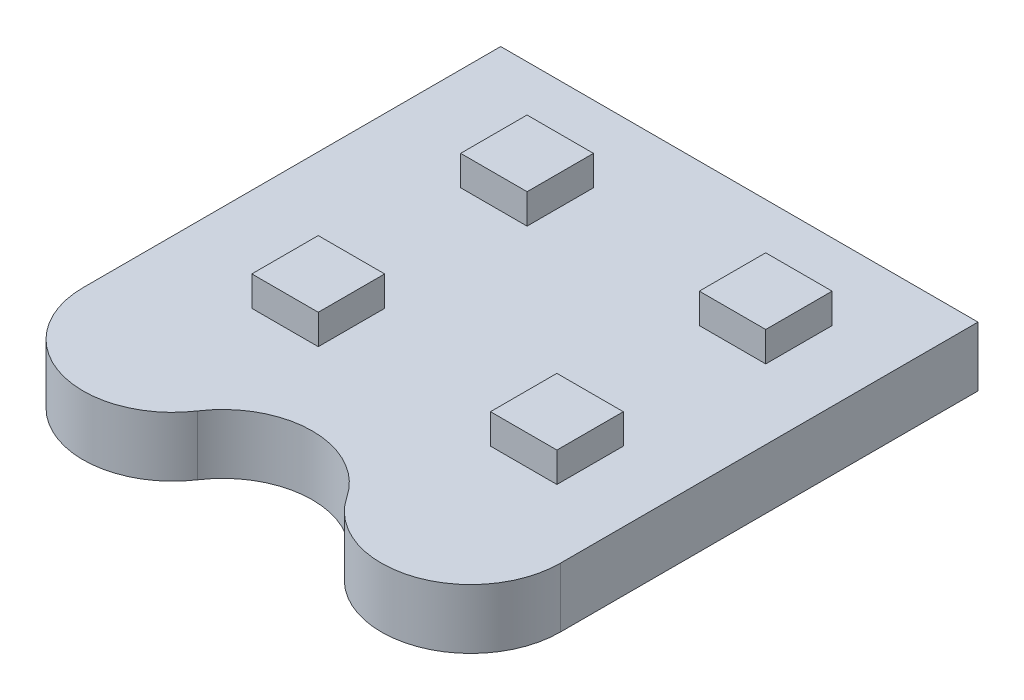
from build123d import *

# Parameters (mm, degrees)
EXTRUDE1_DEPTH       = 12.7
SKETCH3_W            = 14.141940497
SKETCH3_H            = 14.132678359
EXTRUDE2_DEPTH       = 6.35
LPATTERN1_COUNT      = 2
LPATTERN1_PITCH      = 44.45
LPATTERN1_COUNT_DIR2 = 2
LPATTERN1_PITCH_DIR2 = 50.8


with BuildPart() as part:
    # Sketch1 → Extrude1 (new body)
    with BuildSketch(Plane(origin=(0, 0, 0), x_dir=(1, 0, 0), z_dir=(0, 1, 0))):
        with BuildLine():
            Line((0, -88.9), (0, 0))
            Line((0, 0), (101.6, 0))
            Line((101.6, 0), (101.6, -88.9))
            ThreePointArc((101.6, -88.9), (88.049261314, -107.138986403), (66.675, -99.430283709))
            ThreePointArc((66.675, -99.430283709), (50.8, -90.910567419), (34.925, -99.430283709))
            ThreePointArc((34.925, -99.430283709), (13.550738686, -107.138986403), (0, -88.9))
        make_face()
    extrude(amount=EXTRUDE1_DEPTH)

    # Sketch3 → Extrude2 (add)
    with BuildSketch(Plane(origin=(0, 12.7, 0), x_dir=(-1, 0, 0), z_dir=(0, 1, 0))):
        with Locations((-79.650958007, 23.240066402)):
            Rectangle(SKETCH3_W, SKETCH3_H)
    extrude2 = extrude(amount=EXTRUDE2_DEPTH)

    # LPattern1: Extrude2 2 × 2
    with Locations(*[(-j * LPATTERN1_PITCH_DIR2, 0, i * LPATTERN1_PITCH) for i in range(LPATTERN1_COUNT) for j in range(LPATTERN1_COUNT_DIR2) if (i, j) != (0, 0)]):
        add(extrude2)


solid = part.part
